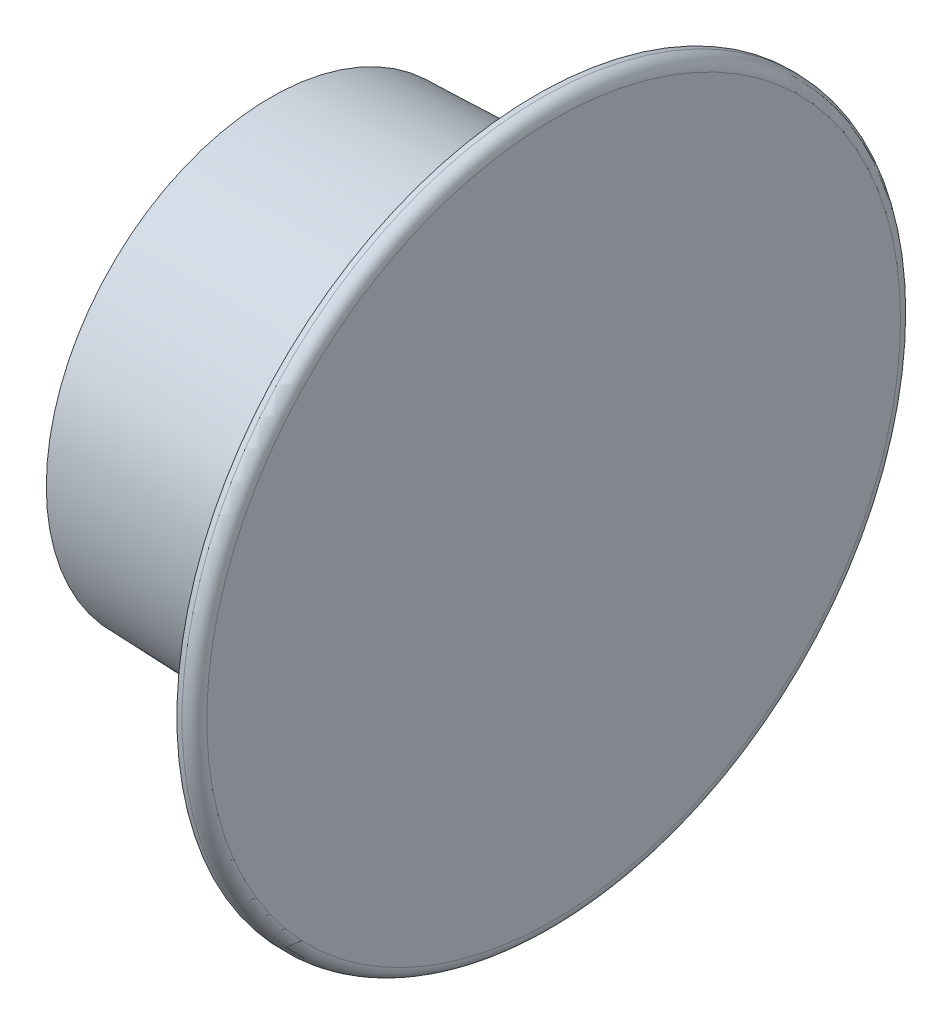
ISO-10303-21;
HEADER;
FILE_DESCRIPTION(('STEP AP214'),'2;1');
FILE_NAME('part.step','',(''),(''),'','','');
FILE_SCHEMA(('AUTOMOTIVE_DESIGN { 1 0 10303 214 1 1 1 1 }'));
ENDSEC;
DATA;
#1=APPLICATION_CONTEXT('core data for automotive mechanical design processes');
#2=APPLICATION_PROTOCOL_DEFINITION('international standard','automotive_design',2000,#1);
#3=PRODUCT_CONTEXT('',#1,'mechanical');
#4=PRODUCT('Part','Part','',(#3));
#5=PRODUCT_RELATED_PRODUCT_CATEGORY('part','',(#4));
#6=PRODUCT_DEFINITION_FORMATION('','',#4);
#7=PRODUCT_DEFINITION_CONTEXT('part definition',#1,'design');
#8=PRODUCT_DEFINITION('design','',#6,#7);
#9=PRODUCT_DEFINITION_SHAPE('','',#8);
#10=(LENGTH_UNIT() NAMED_UNIT(*) SI_UNIT(.MILLI.,.METRE.));
#11=(NAMED_UNIT(*) PLANE_ANGLE_UNIT() SI_UNIT($,.RADIAN.));
#12=(NAMED_UNIT(*) SI_UNIT($,.STERADIAN.) SOLID_ANGLE_UNIT());
#13=UNCERTAINTY_MEASURE_WITH_UNIT(LENGTH_MEASURE(1.E-05),#10,'distance_accuracy_value','');
#14=(GEOMETRIC_REPRESENTATION_CONTEXT(3) GLOBAL_UNCERTAINTY_ASSIGNED_CONTEXT((#13)) GLOBAL_UNIT_ASSIGNED_CONTEXT((#10,
#11,#12)) REPRESENTATION_CONTEXT('',''));
#15=CARTESIAN_POINT('',(0.,0.,0.));
#16=DIRECTION('',(0.,0.,1.));
#17=DIRECTION('',(1.,0.,0.));
#18=AXIS2_PLACEMENT_3D('',#15,#16,#17);
#19=CARTESIAN_POINT('',(0.,0.,0.));
#20=DIRECTION('',(1.,0.,0.));
#21=DIRECTION('',(0.,0.,-1.));
#22=AXIS2_PLACEMENT_3D('',#19,#20,#21);
#23=PLANE('',#22);
#24=CARTESIAN_POINT('',(0.,0.,0.));
#25=DIRECTION('',(1.,0.,0.));
#26=DIRECTION('',(0.,0.,-1.));
#27=AXIS2_PLACEMENT_3D('',#24,#25,#26);
#28=CIRCLE('',#27,10.668);
#29=CARTESIAN_POINT('',(0.,0.,-10.668));
#30=VERTEX_POINT('',#29);
#31=EDGE_CURVE('E35',#30,#30,#28,.T.);
#32=ORIENTED_EDGE('',*,*,#31,.T.);
#33=EDGE_LOOP('',(#32));
#34=FACE_BOUND('',#33,.T.);
#35=ADVANCED_FACE('F14',(#34),#23,.T.);
#36=CARTESIAN_POINT('',(0.,0.,0.));
#37=DIRECTION('',(1.,0.,0.));
#38=DIRECTION('',(0.,0.,-1.));
#39=AXIS2_PLACEMENT_3D('',#36,#37,#38);
#40=CYLINDRICAL_SURFACE('',#39,11.049);
#41=CARTESIAN_POINT('',(-0.381,0.,0.));
#42=DIRECTION('',(1.,0.,0.));
#43=DIRECTION('',(0.,0.,-1.));
#44=AXIS2_PLACEMENT_3D('',#41,#42,#43);
#45=CIRCLE('',#44,11.049);
#46=CARTESIAN_POINT('',(-0.381,0.,-11.049));
#47=VERTEX_POINT('',#46);
#48=EDGE_CURVE('E29',#47,#47,#45,.F.);
#49=ORIENTED_EDGE('',*,*,#48,.T.);
#50=EDGE_LOOP('',(#49));
#51=FACE_BOUND('',#50,.T.);
#52=CARTESIAN_POINT('',(-0.53848,0.,0.));
#53=DIRECTION('',(1.,0.,0.));
#54=DIRECTION('',(0.,0.,-1.));
#55=AXIS2_PLACEMENT_3D('',#52,#53,#54);
#56=CIRCLE('',#55,11.049);
#57=CARTESIAN_POINT('',(-0.53848,0.,-11.049));
#58=VERTEX_POINT('',#57);
#59=EDGE_CURVE('E41',#58,#58,#56,.T.);
#60=ORIENTED_EDGE('',*,*,#59,.T.);
#61=EDGE_LOOP('',(#60));
#62=FACE_BOUND('',#61,.T.);
#63=ADVANCED_FACE('F67',(#51,#62),#40,.T.);
#64=CARTESIAN_POINT('',(-0.53848,0.,0.));
#65=DIRECTION('',(1.,0.,0.));
#66=DIRECTION('',(0.,0.,-1.));
#67=AXIS2_PLACEMENT_3D('',#64,#65,#66);
#68=CONICAL_SURFACE('',#67,11.049,1.04719755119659);
#69=CARTESIAN_POINT('',(-2.60031626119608,0.,0.));
#70=DIRECTION('',(1.,0.,0.));
#71=DIRECTION('',(0.,0.,-1.));
#72=AXIS2_PLACEMENT_3D('',#69,#70,#71);
#73=CIRCLE('',#72,7.47779483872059);
#74=CARTESIAN_POINT('',(-2.60031626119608,0.,-7.47779483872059));
#75=VERTEX_POINT('',#74);
#76=EDGE_CURVE('E22',#75,#75,#73,.T.);
#77=ORIENTED_EDGE('',*,*,#76,.T.);
#78=EDGE_LOOP('',(#77));
#79=FACE_BOUND('',#78,.T.);
#80=ORIENTED_EDGE('',*,*,#59,.F.);
#81=EDGE_LOOP('',(#80));
#82=FACE_BOUND('',#81,.T.);
#83=ADVANCED_FACE('F64',(#79,#82),#68,.T.);
#84=CARTESIAN_POINT('',(-2.81150800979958,0.,0.));
#85=DIRECTION('',(1.,0.,0.));
#86=DIRECTION('',(0.,0.,-1.));
#87=AXIS2_PLACEMENT_3D('',#84,#85,#86);
#88=CONICAL_SURFACE('',#87,7.112,0.0349065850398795);
#89=CARTESIAN_POINT('',(-3.23363420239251,0.,0.));
#90=DIRECTION('',(1.,0.,0.));
#91=DIRECTION('',(0.,0.,-1.));
#92=AXIS2_PLACEMENT_3D('',#89,#90,#91);
#93=CIRCLE('',#92,7.09725902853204);
#94=CARTESIAN_POINT('',(-3.23363420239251,0.,-7.09725902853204));
#95=VERTEX_POINT('',#94);
#96=EDGE_CURVE('E9',#95,#95,#93,.F.);
#97=ORIENTED_EDGE('',*,*,#96,.T.);
#98=EDGE_LOOP('',(#97));
#99=FACE_BOUND('',#98,.T.);
#100=CARTESIAN_POINT('',(-8.69696,0.,0.));
#101=DIRECTION('',(1.,0.,0.));
#102=DIRECTION('',(0.,0.,-1.));
#103=AXIS2_PLACEMENT_3D('',#100,#101,#102);
#104=CIRCLE('',#103,6.90647548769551);
#105=CARTESIAN_POINT('',(-8.69696,0.,-6.90647548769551));
#106=VERTEX_POINT('',#105);
#107=EDGE_CURVE('E45',#106,#106,#104,.T.);
#108=ORIENTED_EDGE('',*,*,#107,.T.);
#109=EDGE_LOOP('',(#108));
#110=FACE_BOUND('',#109,.T.);
#111=ADVANCED_FACE('F51',(#99,#110),#88,.T.);
#112=CARTESIAN_POINT('',(-8.69696,6.90647548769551,0.));
#113=DIRECTION('',(-1.,0.,0.));
#114=DIRECTION('',(0.,0.,1.));
#115=AXIS2_PLACEMENT_3D('',#112,#113,#114);
#116=PLANE('',#115);
#117=ORIENTED_EDGE('',*,*,#107,.F.);
#118=EDGE_LOOP('',(#117));
#119=FACE_BOUND('',#118,.T.);
#120=ADVANCED_FACE('F53',(#119),#116,.T.);
#121=CARTESIAN_POINT('',(-0.381,0.,0.));
#122=DIRECTION('',(1.,0.,0.));
#123=DIRECTION('',(0.,0.,-1.));
#124=AXIS2_PLACEMENT_3D('',#121,#122,#123);
#125=TOROIDAL_SURFACE('',#124,10.668,0.381);
#126=ORIENTED_EDGE('',*,*,#48,.F.);
#127=EDGE_LOOP('',(#126));
#128=FACE_BOUND('',#127,.T.);
#129=ORIENTED_EDGE('',*,*,#31,.F.);
#130=EDGE_LOOP('',(#129));
#131=FACE_BOUND('',#130,.T.);
#132=ADVANCED_FACE('F55',(#128,#131),#125,.T.);
#133=CARTESIAN_POINT('',(-3.26022761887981,0.,0.));
#134=DIRECTION('',(1.,0.,0.));
#135=DIRECTION('',(0.,0.,-1.));
#136=AXIS2_PLACEMENT_3D('',#133,#134,#135);
#137=TOROIDAL_SURFACE('',#136,7.85879483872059,0.762);
#138=ORIENTED_EDGE('',*,*,#96,.F.);
#139=EDGE_LOOP('',(#138));
#140=FACE_BOUND('',#139,.T.);
#141=ORIENTED_EDGE('',*,*,#76,.F.);
#142=EDGE_LOOP('',(#141));
#143=FACE_BOUND('',#142,.T.);
#144=ADVANCED_FACE('F16',(#140,#143),#137,.F.);
#145=CLOSED_SHELL('',(#35,#63,#83,#111,#120,#132,#144));
#146=MANIFOLD_SOLID_BREP('B1',#145);
#147=ADVANCED_BREP_SHAPE_REPRESENTATION('',(#18,#146),#14);
#148=SHAPE_DEFINITION_REPRESENTATION(#9,#147);
ENDSEC;
END-ISO-10303-21;
